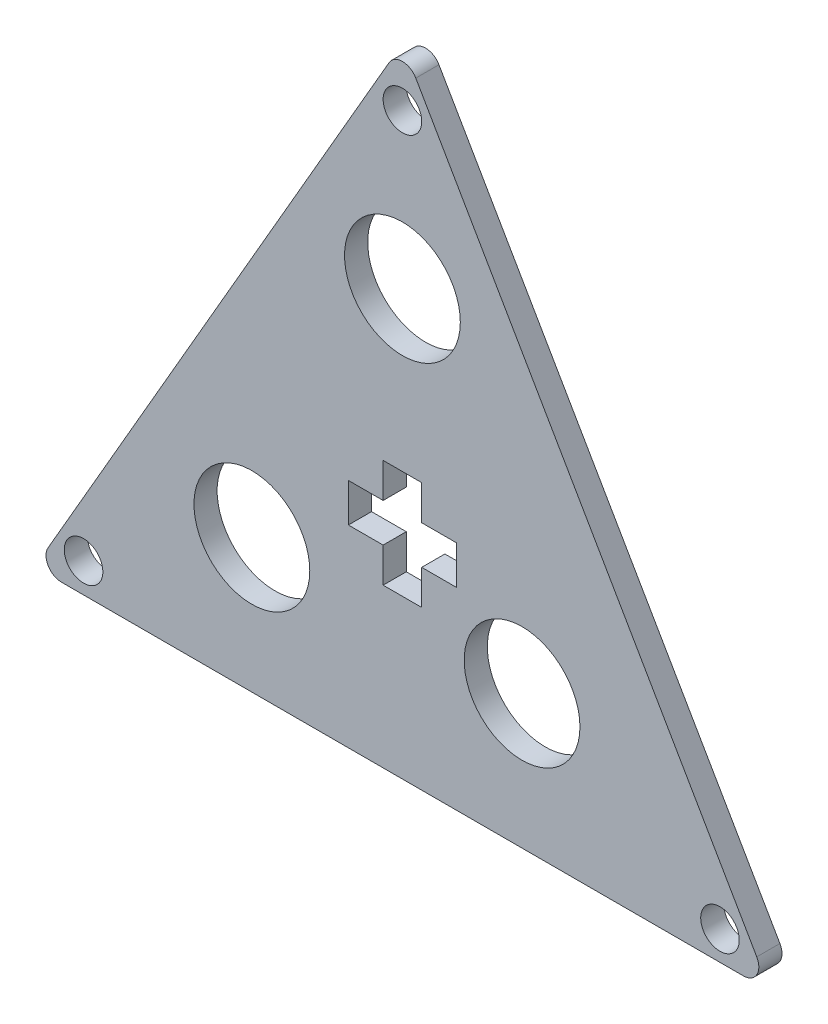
ISO-10303-21;
HEADER;
FILE_DESCRIPTION(('STEP AP214'),'2;1');
FILE_NAME('part.step','',(''),(''),'','','');
FILE_SCHEMA(('AUTOMOTIVE_DESIGN { 1 0 10303 214 1 1 1 1 }'));
ENDSEC;
DATA;
#1=APPLICATION_CONTEXT('core data for automotive mechanical design processes');
#2=APPLICATION_PROTOCOL_DEFINITION('international standard','automotive_design',2000,#1);
#3=PRODUCT_CONTEXT('',#1,'mechanical');
#4=PRODUCT('Part','Part','',(#3));
#5=PRODUCT_RELATED_PRODUCT_CATEGORY('part','',(#4));
#6=PRODUCT_DEFINITION_FORMATION('','',#4);
#7=PRODUCT_DEFINITION_CONTEXT('part definition',#1,'design');
#8=PRODUCT_DEFINITION('design','',#6,#7);
#9=PRODUCT_DEFINITION_SHAPE('','',#8);
#10=(LENGTH_UNIT() NAMED_UNIT(*) SI_UNIT(.MILLI.,.METRE.));
#11=(NAMED_UNIT(*) PLANE_ANGLE_UNIT() SI_UNIT($,.RADIAN.));
#12=(NAMED_UNIT(*) SI_UNIT($,.STERADIAN.) SOLID_ANGLE_UNIT());
#13=UNCERTAINTY_MEASURE_WITH_UNIT(LENGTH_MEASURE(1.E-05),#10,'distance_accuracy_value','');
#14=(GEOMETRIC_REPRESENTATION_CONTEXT(3) GLOBAL_UNCERTAINTY_ASSIGNED_CONTEXT((#13)) GLOBAL_UNIT_ASSIGNED_CONTEXT((#10,
#11,#12)) REPRESENTATION_CONTEXT('',''));
#15=CARTESIAN_POINT('',(0.,0.,0.));
#16=DIRECTION('',(0.,0.,1.));
#17=DIRECTION('',(1.,0.,0.));
#18=AXIS2_PLACEMENT_3D('',#15,#16,#17);
#19=CARTESIAN_POINT('',(0.,0.,3.));
#20=DIRECTION('',(0.,0.,1.));
#21=DIRECTION('',(1.,0.,0.));
#22=AXIS2_PLACEMENT_3D('',#19,#20,#21);
#23=PLANE('',#22);
#24=DIRECTION('',(1.,0.,0.));
#25=VECTOR('',#24,1.);
#26=CARTESIAN_POINT('',(-47.6313972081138,-27.500000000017,3.));
#27=LINE('',#26,#25);
#28=CARTESIAN_POINT('',(-44.167295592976,-27.500000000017,3.));
#29=VERTEX_POINT('',#28);
#30=CARTESIAN_POINT('',(44.1672955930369,-27.500000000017,3.));
#31=VERTEX_POINT('',#30);
#32=EDGE_CURVE('E320',#29,#31,#27,.T.);
#33=ORIENTED_EDGE('',*,*,#32,.T.);
#34=CARTESIAN_POINT('',(44.1672955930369,-25.500000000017,3.));
#35=DIRECTION('',(0.,0.,1.));
#36=DIRECTION('',(1.,0.,0.));
#37=AXIS2_PLACEMENT_3D('',#34,#35,#36);
#38=CIRCLE('',#37,2.);
#39=CARTESIAN_POINT('',(45.8993464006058,-24.500000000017,3.));
#40=VERTEX_POINT('',#39);
#41=EDGE_CURVE('E350',#31,#40,#38,.T.);
#42=ORIENTED_EDGE('',*,*,#41,.T.);
#43=DIRECTION('',(-0.500000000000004,0.866025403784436,0.));
#44=VECTOR('',#43,1.);
#45=CARTESIAN_POINT('',(47.6313972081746,-27.500000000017,3.));
#46=LINE('',#45,#44);
#47=CARTESIAN_POINT('',(1.73205080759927,51.9999999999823,3.));
#48=VERTEX_POINT('',#47);
#49=EDGE_CURVE('E313',#40,#48,#46,.T.);
#50=ORIENTED_EDGE('',*,*,#49,.T.);
#51=CARTESIAN_POINT('',(3.04101362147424E-11,50.9999999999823,3.));
#52=DIRECTION('',(0.,0.,1.));
#53=DIRECTION('',(1.,0.,0.));
#54=AXIS2_PLACEMENT_3D('',#51,#52,#53);
#55=CIRCLE('',#54,2.);
#56=CARTESIAN_POINT('',(-1.73205080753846,51.9999999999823,3.));
#57=VERTEX_POINT('',#56);
#58=EDGE_CURVE('E346',#48,#57,#55,.T.);
#59=ORIENTED_EDGE('',*,*,#58,.T.);
#60=DIRECTION('',(-0.500000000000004,-0.866025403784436,0.));
#61=VECTOR('',#60,1.);
#62=CARTESIAN_POINT('',(3.04090086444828E-11,54.9999999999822,3.));
#63=LINE('',#62,#61);
#64=CARTESIAN_POINT('',(-45.8993464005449,-24.500000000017,3.));
#65=VERTEX_POINT('',#64);
#66=EDGE_CURVE('E316',#57,#65,#63,.T.);
#67=ORIENTED_EDGE('',*,*,#66,.T.);
#68=CARTESIAN_POINT('',(-44.167295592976,-25.500000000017,3.));
#69=DIRECTION('',(0.,0.,1.));
#70=DIRECTION('',(1.,0.,0.));
#71=AXIS2_PLACEMENT_3D('',#68,#69,#70);
#72=CIRCLE('',#71,2.);
#73=EDGE_CURVE('E348',#65,#29,#72,.T.);
#74=ORIENTED_EDGE('',*,*,#73,.T.);
#75=EDGE_LOOP('',(#33,#42,#50,#59,#67,#74));
#76=FACE_BOUND('',#75,.T.);
#77=CARTESIAN_POINT('',(15.4976039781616,-10.148880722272,3.));
#78=DIRECTION('',(0.,0.,1.));
#79=DIRECTION('',(1.,0.,0.));
#80=AXIS2_PLACEMENT_3D('',#77,#78,#79);
#81=CIRCLE('',#80,7.5);
#82=CARTESIAN_POINT('',(22.9976039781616,-10.148880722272,3.));
#83=VERTEX_POINT('',#82);
#84=EDGE_CURVE('E308',#83,#83,#81,.T.);
#85=ORIENTED_EDGE('',*,*,#84,.F.);
#86=EDGE_LOOP('',(#85));
#87=FACE_BOUND('',#86,.T.);
#88=CARTESIAN_POINT('',(-19.5023960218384,-10.148880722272,3.));
#89=DIRECTION('',(0.,0.,1.));
#90=DIRECTION('',(1.,0.,0.));
#91=AXIS2_PLACEMENT_3D('',#88,#89,#90);
#92=CIRCLE('',#91,7.5);
#93=CARTESIAN_POINT('',(-12.0023960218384,-10.148880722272,3.));
#94=VERTEX_POINT('',#93);
#95=EDGE_CURVE('E302',#94,#94,#92,.T.);
#96=ORIENTED_EDGE('',*,*,#95,.F.);
#97=EDGE_LOOP('',(#96));
#98=FACE_BOUND('',#97,.T.);
#99=CARTESIAN_POINT('',(0.,27.4999999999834,3.));
#100=DIRECTION('',(0.,0.,1.));
#101=DIRECTION('',(1.,0.,0.));
#102=AXIS2_PLACEMENT_3D('',#99,#100,#101);
#103=CIRCLE('',#102,7.50000000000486);
#104=CARTESIAN_POINT('',(7.50000000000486,27.4999999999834,3.));
#105=VERTEX_POINT('',#104);
#106=EDGE_CURVE('E299',#105,#105,#103,.T.);
#107=ORIENTED_EDGE('',*,*,#106,.F.);
#108=EDGE_LOOP('',(#107));
#109=FACE_BOUND('',#108,.T.);
#110=CARTESIAN_POINT('',(41.1362066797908,-23.7500000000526,3.));
#111=DIRECTION('',(0.,0.,1.));
#112=DIRECTION('',(-1.,0.,0.));
#113=AXIS2_PLACEMENT_3D('',#110,#111,#112);
#114=CIRCLE('',#113,2.50000000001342);
#115=CARTESIAN_POINT('',(38.6362066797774,-23.7500000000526,3.));
#116=VERTEX_POINT('',#115);
#117=EDGE_CURVE('E290',#116,#116,#114,.T.);
#118=ORIENTED_EDGE('',*,*,#117,.F.);
#119=EDGE_LOOP('',(#118));
#120=FACE_BOUND('',#119,.T.);
#121=CARTESIAN_POINT('',(-41.3052240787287,-23.6714710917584,3.));
#122=DIRECTION('',(0.,0.,1.));
#123=DIRECTION('',(-1.,0.,0.));
#124=AXIS2_PLACEMENT_3D('',#121,#122,#123);
#125=CIRCLE('',#124,2.50000000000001);
#126=CARTESIAN_POINT('',(-43.8052240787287,-23.6714710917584,3.));
#127=VERTEX_POINT('',#126);
#128=EDGE_CURVE('E284',#127,#127,#125,.T.);
#129=ORIENTED_EDGE('',*,*,#128,.F.);
#130=EDGE_LOOP('',(#129));
#131=FACE_BOUND('',#130,.T.);
#132=CARTESIAN_POINT('',(0.,47.5,3.));
#133=DIRECTION('',(0.,0.,1.));
#134=DIRECTION('',(1.,0.,0.));
#135=AXIS2_PLACEMENT_3D('',#132,#133,#134);
#136=CIRCLE('',#135,2.5);
#137=CARTESIAN_POINT('',(2.5,47.5,3.));
#138=VERTEX_POINT('',#137);
#139=EDGE_CURVE('E281',#138,#138,#136,.T.);
#140=ORIENTED_EDGE('',*,*,#139,.F.);
#141=EDGE_LOOP('',(#140));
#142=FACE_BOUND('',#141,.T.);
#143=DIRECTION('',(0.,1.,0.));
#144=VECTOR('',#143,1.);
#145=CARTESIAN_POINT('',(2.5,-7.,3.));
#146=LINE('',#145,#144);
#147=CARTESIAN_POINT('',(2.5,-7.,3.));
#148=VERTEX_POINT('',#147);
#149=CARTESIAN_POINT('',(2.5,-2.5,3.));
#150=VERTEX_POINT('',#149);
#151=EDGE_CURVE('E224',#148,#150,#146,.T.);
#152=ORIENTED_EDGE('',*,*,#151,.F.);
#153=DIRECTION('',(-1.,0.,0.));
#154=VECTOR('',#153,1.);
#155=CARTESIAN_POINT('',(2.5,-7.,3.));
#156=LINE('',#155,#154);
#157=CARTESIAN_POINT('',(-2.5,-7.,3.));
#158=VERTEX_POINT('',#157);
#159=EDGE_CURVE('E213',#148,#158,#156,.T.);
#160=ORIENTED_EDGE('',*,*,#159,.T.);
#161=DIRECTION('',(0.,1.,0.));
#162=VECTOR('',#161,1.);
#163=CARTESIAN_POINT('',(-2.5,-7.,3.));
#164=LINE('',#163,#162);
#165=CARTESIAN_POINT('',(-2.5,-2.5,3.));
#166=VERTEX_POINT('',#165);
#167=EDGE_CURVE('E217',#158,#166,#164,.T.);
#168=ORIENTED_EDGE('',*,*,#167,.T.);
#169=DIRECTION('',(-1.,0.,0.));
#170=VECTOR('',#169,1.);
#171=CARTESIAN_POINT('',(7.,-2.5,3.));
#172=LINE('',#171,#170);
#173=CARTESIAN_POINT('',(-7.,-2.5,3.));
#174=VERTEX_POINT('',#173);
#175=EDGE_CURVE('E258',#166,#174,#172,.T.);
#176=ORIENTED_EDGE('',*,*,#175,.T.);
#177=DIRECTION('',(0.,1.,0.));
#178=VECTOR('',#177,1.);
#179=CARTESIAN_POINT('',(-7.,-2.5,3.));
#180=LINE('',#179,#178);
#181=CARTESIAN_POINT('',(-7.,2.5,3.));
#182=VERTEX_POINT('',#181);
#183=EDGE_CURVE('E255',#174,#182,#180,.T.);
#184=ORIENTED_EDGE('',*,*,#183,.T.);
#185=DIRECTION('',(-1.,0.,0.));
#186=VECTOR('',#185,1.);
#187=CARTESIAN_POINT('',(7.,2.5,3.));
#188=LINE('',#187,#186);
#189=CARTESIAN_POINT('',(-2.5,2.5,3.));
#190=VERTEX_POINT('',#189);
#191=EDGE_CURVE('E251',#190,#182,#188,.T.);
#192=ORIENTED_EDGE('',*,*,#191,.F.);
#193=CARTESIAN_POINT('',(-2.5,7.,3.));
#194=VERTEX_POINT('',#193);
#195=EDGE_CURVE('E229',#190,#194,#164,.T.);
#196=ORIENTED_EDGE('',*,*,#195,.T.);
#197=DIRECTION('',(-1.,0.,0.));
#198=VECTOR('',#197,1.);
#199=CARTESIAN_POINT('',(2.5,7.,3.));
#200=LINE('',#199,#198);
#201=CARTESIAN_POINT('',(2.5,7.,3.));
#202=VERTEX_POINT('',#201);
#203=EDGE_CURVE('E227',#202,#194,#200,.T.);
#204=ORIENTED_EDGE('',*,*,#203,.F.);
#205=CARTESIAN_POINT('',(2.5,2.5,3.));
#206=VERTEX_POINT('',#205);
#207=EDGE_CURVE('E191',#206,#202,#146,.T.);
#208=ORIENTED_EDGE('',*,*,#207,.F.);
#209=CARTESIAN_POINT('',(7.,2.5,3.));
#210=VERTEX_POINT('',#209);
#211=EDGE_CURVE('E252',#210,#206,#188,.T.);
#212=ORIENTED_EDGE('',*,*,#211,.F.);
#213=DIRECTION('',(0.,1.,0.));
#214=VECTOR('',#213,1.);
#215=CARTESIAN_POINT('',(7.,-2.5,3.));
#216=LINE('',#215,#214);
#217=CARTESIAN_POINT('',(7.,-2.5,3.));
#218=VERTEX_POINT('',#217);
#219=EDGE_CURVE('E80',#218,#210,#216,.T.);
#220=ORIENTED_EDGE('',*,*,#219,.F.);
#221=EDGE_CURVE('E241',#218,#150,#172,.T.);
#222=ORIENTED_EDGE('',*,*,#221,.T.);
#223=EDGE_LOOP('',(#152,#160,#168,#176,#184,#192,#196,#204,#208,#212,#220,#222));
#224=FACE_BOUND('',#223,.T.);
#225=ADVANCED_FACE('F65',(#76,#87,#98,#109,#120,#131,#142,#224),#23,.T.);
#226=CARTESIAN_POINT('',(0.,0.,0.));
#227=DIRECTION('',(0.,0.,1.));
#228=DIRECTION('',(1.,0.,0.));
#229=AXIS2_PLACEMENT_3D('',#226,#227,#228);
#230=PLANE('',#229);
#231=DIRECTION('',(-0.500000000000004,0.866025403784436,0.));
#232=VECTOR('',#231,1.);
#233=CARTESIAN_POINT('',(47.6313972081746,-27.500000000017,0.));
#234=LINE('',#233,#232);
#235=CARTESIAN_POINT('',(45.8993464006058,-24.500000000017,0.));
#236=VERTEX_POINT('',#235);
#237=CARTESIAN_POINT('',(1.73205080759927,51.9999999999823,0.));
#238=VERTEX_POINT('',#237);
#239=EDGE_CURVE('E298',#236,#238,#234,.T.);
#240=ORIENTED_EDGE('',*,*,#239,.F.);
#241=CARTESIAN_POINT('',(44.1672955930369,-25.500000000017,0.));
#242=DIRECTION('',(0.,0.,1.));
#243=DIRECTION('',(1.,0.,0.));
#244=AXIS2_PLACEMENT_3D('',#241,#242,#243);
#245=CIRCLE('',#244,2.);
#246=CARTESIAN_POINT('',(44.1672955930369,-27.500000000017,0.));
#247=VERTEX_POINT('',#246);
#248=EDGE_CURVE('E339',#236,#247,#245,.F.);
#249=ORIENTED_EDGE('',*,*,#248,.T.);
#250=DIRECTION('',(1.,0.,0.));
#251=VECTOR('',#250,1.);
#252=CARTESIAN_POINT('',(-47.6313972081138,-27.500000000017,0.));
#253=LINE('',#252,#251);
#254=CARTESIAN_POINT('',(-44.167295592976,-27.500000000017,0.));
#255=VERTEX_POINT('',#254);
#256=EDGE_CURVE('E317',#255,#247,#253,.T.);
#257=ORIENTED_EDGE('',*,*,#256,.F.);
#258=CARTESIAN_POINT('',(-44.167295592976,-25.500000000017,0.));
#259=DIRECTION('',(0.,0.,1.));
#260=DIRECTION('',(1.,0.,0.));
#261=AXIS2_PLACEMENT_3D('',#258,#259,#260);
#262=CIRCLE('',#261,2.);
#263=CARTESIAN_POINT('',(-45.8993464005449,-24.500000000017,0.));
#264=VERTEX_POINT('',#263);
#265=EDGE_CURVE('E337',#255,#264,#262,.F.);
#266=ORIENTED_EDGE('',*,*,#265,.T.);
#267=DIRECTION('',(-0.500000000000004,-0.866025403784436,0.));
#268=VECTOR('',#267,1.);
#269=CARTESIAN_POINT('',(3.04090086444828E-11,54.9999999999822,0.));
#270=LINE('',#269,#268);
#271=CARTESIAN_POINT('',(-1.73205080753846,51.9999999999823,0.));
#272=VERTEX_POINT('',#271);
#273=EDGE_CURVE('E326',#272,#264,#270,.T.);
#274=ORIENTED_EDGE('',*,*,#273,.F.);
#275=CARTESIAN_POINT('',(3.04101362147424E-11,50.9999999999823,0.));
#276=DIRECTION('',(0.,0.,1.));
#277=DIRECTION('',(1.,0.,0.));
#278=AXIS2_PLACEMENT_3D('',#275,#276,#277);
#279=CIRCLE('',#278,2.);
#280=EDGE_CURVE('E335',#272,#238,#279,.F.);
#281=ORIENTED_EDGE('',*,*,#280,.T.);
#282=EDGE_LOOP('',(#240,#249,#257,#266,#274,#281));
#283=FACE_BOUND('',#282,.T.);
#284=CARTESIAN_POINT('',(15.4976039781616,-10.148880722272,0.));
#285=DIRECTION('',(0.,0.,1.));
#286=DIRECTION('',(1.,0.,0.));
#287=AXIS2_PLACEMENT_3D('',#284,#285,#286);
#288=CIRCLE('',#287,7.5);
#289=CARTESIAN_POINT('',(22.9976039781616,-10.148880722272,0.));
#290=VERTEX_POINT('',#289);
#291=EDGE_CURVE('E280',#290,#290,#288,.T.);
#292=ORIENTED_EDGE('',*,*,#291,.T.);
#293=EDGE_LOOP('',(#292));
#294=FACE_BOUND('',#293,.T.);
#295=CARTESIAN_POINT('',(-19.5023960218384,-10.148880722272,0.));
#296=DIRECTION('',(0.,0.,1.));
#297=DIRECTION('',(1.,0.,0.));
#298=AXIS2_PLACEMENT_3D('',#295,#296,#297);
#299=CIRCLE('',#298,7.5);
#300=CARTESIAN_POINT('',(-12.0023960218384,-10.148880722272,0.));
#301=VERTEX_POINT('',#300);
#302=EDGE_CURVE('E305',#301,#301,#299,.T.);
#303=ORIENTED_EDGE('',*,*,#302,.T.);
#304=EDGE_LOOP('',(#303));
#305=FACE_BOUND('',#304,.T.);
#306=CARTESIAN_POINT('',(0.,27.4999999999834,0.));
#307=DIRECTION('',(0.,0.,1.));
#308=DIRECTION('',(1.,0.,0.));
#309=AXIS2_PLACEMENT_3D('',#306,#307,#308);
#310=CIRCLE('',#309,7.50000000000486);
#311=CARTESIAN_POINT('',(7.50000000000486,27.4999999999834,0.));
#312=VERTEX_POINT('',#311);
#313=EDGE_CURVE('E295',#312,#312,#310,.T.);
#314=ORIENTED_EDGE('',*,*,#313,.T.);
#315=EDGE_LOOP('',(#314));
#316=FACE_BOUND('',#315,.T.);
#317=CARTESIAN_POINT('',(41.1362066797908,-23.7500000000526,0.));
#318=DIRECTION('',(0.,0.,1.));
#319=DIRECTION('',(-1.,0.,0.));
#320=AXIS2_PLACEMENT_3D('',#317,#318,#319);
#321=CIRCLE('',#320,2.50000000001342);
#322=CARTESIAN_POINT('',(38.6362066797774,-23.7500000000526,0.));
#323=VERTEX_POINT('',#322);
#324=EDGE_CURVE('E276',#323,#323,#321,.T.);
#325=ORIENTED_EDGE('',*,*,#324,.T.);
#326=EDGE_LOOP('',(#325));
#327=FACE_BOUND('',#326,.T.);
#328=CARTESIAN_POINT('',(-41.3052240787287,-23.6714710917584,0.));
#329=DIRECTION('',(0.,0.,1.));
#330=DIRECTION('',(-1.,0.,0.));
#331=AXIS2_PLACEMENT_3D('',#328,#329,#330);
#332=CIRCLE('',#331,2.50000000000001);
#333=CARTESIAN_POINT('',(-43.8052240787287,-23.6714710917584,0.));
#334=VERTEX_POINT('',#333);
#335=EDGE_CURVE('E287',#334,#334,#332,.T.);
#336=ORIENTED_EDGE('',*,*,#335,.T.);
#337=EDGE_LOOP('',(#336));
#338=FACE_BOUND('',#337,.T.);
#339=CARTESIAN_POINT('',(0.,47.5,0.));
#340=DIRECTION('',(0.,0.,1.));
#341=DIRECTION('',(1.,0.,0.));
#342=AXIS2_PLACEMENT_3D('',#339,#340,#341);
#343=CIRCLE('',#342,2.5);
#344=CARTESIAN_POINT('',(2.5,47.5,0.));
#345=VERTEX_POINT('',#344);
#346=EDGE_CURVE('E277',#345,#345,#343,.T.);
#347=ORIENTED_EDGE('',*,*,#346,.T.);
#348=EDGE_LOOP('',(#347));
#349=FACE_BOUND('',#348,.T.);
#350=DIRECTION('',(-1.,0.,0.));
#351=VECTOR('',#350,1.);
#352=CARTESIAN_POINT('',(2.5,-7.,0.));
#353=LINE('',#352,#351);
#354=CARTESIAN_POINT('',(2.5,-7.,0.));
#355=VERTEX_POINT('',#354);
#356=CARTESIAN_POINT('',(-2.5,-7.,0.));
#357=VERTEX_POINT('',#356);
#358=EDGE_CURVE('E196',#355,#357,#353,.T.);
#359=ORIENTED_EDGE('',*,*,#358,.F.);
#360=DIRECTION('',(0.,1.,0.));
#361=VECTOR('',#360,1.);
#362=CARTESIAN_POINT('',(2.5,-7.,0.));
#363=LINE('',#362,#361);
#364=CARTESIAN_POINT('',(2.5,-2.5,0.));
#365=VERTEX_POINT('',#364);
#366=EDGE_CURVE('E205',#355,#365,#363,.T.);
#367=ORIENTED_EDGE('',*,*,#366,.T.);
#368=DIRECTION('',(-1.,0.,0.));
#369=VECTOR('',#368,1.);
#370=CARTESIAN_POINT('',(7.,-2.5,0.));
#371=LINE('',#370,#369);
#372=CARTESIAN_POINT('',(7.,-2.5,0.));
#373=VERTEX_POINT('',#372);
#374=EDGE_CURVE('E246',#373,#365,#371,.T.);
#375=ORIENTED_EDGE('',*,*,#374,.F.);
#376=DIRECTION('',(0.,1.,0.));
#377=VECTOR('',#376,1.);
#378=CARTESIAN_POINT('',(7.,-2.5,0.));
#379=LINE('',#378,#377);
#380=CARTESIAN_POINT('',(7.,2.5,0.));
#381=VERTEX_POINT('',#380);
#382=EDGE_CURVE('E238',#373,#381,#379,.T.);
#383=ORIENTED_EDGE('',*,*,#382,.T.);
#384=DIRECTION('',(-1.,0.,0.));
#385=VECTOR('',#384,1.);
#386=CARTESIAN_POINT('',(7.,2.5,0.));
#387=LINE('',#386,#385);
#388=CARTESIAN_POINT('',(2.5,2.5,0.));
#389=VERTEX_POINT('',#388);
#390=EDGE_CURVE('E212',#381,#389,#387,.T.);
#391=ORIENTED_EDGE('',*,*,#390,.T.);
#392=CARTESIAN_POINT('',(2.5,7.,0.));
#393=VERTEX_POINT('',#392);
#394=EDGE_CURVE('E88',#389,#393,#363,.T.);
#395=ORIENTED_EDGE('',*,*,#394,.T.);
#396=DIRECTION('',(-1.,0.,0.));
#397=VECTOR('',#396,1.);
#398=CARTESIAN_POINT('',(2.5,7.,0.));
#399=LINE('',#398,#397);
#400=CARTESIAN_POINT('',(-2.5,7.,0.));
#401=VERTEX_POINT('',#400);
#402=EDGE_CURVE('E200',#393,#401,#399,.T.);
#403=ORIENTED_EDGE('',*,*,#402,.T.);
#404=DIRECTION('',(0.,1.,0.));
#405=VECTOR('',#404,1.);
#406=CARTESIAN_POINT('',(-2.5,-7.,0.));
#407=LINE('',#406,#405);
#408=CARTESIAN_POINT('',(-2.5,2.5,0.));
#409=VERTEX_POINT('',#408);
#410=EDGE_CURVE('E204',#409,#401,#407,.T.);
#411=ORIENTED_EDGE('',*,*,#410,.F.);
#412=CARTESIAN_POINT('',(-7.,2.5,0.));
#413=VERTEX_POINT('',#412);
#414=EDGE_CURVE('E240',#409,#413,#387,.T.);
#415=ORIENTED_EDGE('',*,*,#414,.T.);
#416=DIRECTION('',(0.,1.,0.));
#417=VECTOR('',#416,1.);
#418=CARTESIAN_POINT('',(-7.,-2.5,0.));
#419=LINE('',#418,#417);
#420=CARTESIAN_POINT('',(-7.,-2.5,0.));
#421=VERTEX_POINT('',#420);
#422=EDGE_CURVE('E243',#421,#413,#419,.T.);
#423=ORIENTED_EDGE('',*,*,#422,.F.);
#424=CARTESIAN_POINT('',(-2.5,-2.5,0.));
#425=VERTEX_POINT('',#424);
#426=EDGE_CURVE('E245',#425,#421,#371,.T.);
#427=ORIENTED_EDGE('',*,*,#426,.F.);
#428=EDGE_CURVE('E220',#357,#425,#407,.T.);
#429=ORIENTED_EDGE('',*,*,#428,.F.);
#430=EDGE_LOOP('',(#359,#367,#375,#383,#391,#395,#403,#411,#415,#423,#427,#429));
#431=FACE_BOUND('',#430,.T.);
#432=ADVANCED_FACE('F209',(#283,#294,#305,#316,#327,#338,#349,#431),#230,.F.);
#433=CARTESIAN_POINT('',(47.6313972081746,-27.500000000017,3.));
#434=DIRECTION('',(-0.866025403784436,-0.500000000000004,0.));
#435=DIRECTION('',(0.500000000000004,-0.866025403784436,0.));
#436=AXIS2_PLACEMENT_3D('',#433,#434,#435);
#437=PLANE('',#436);
#438=ORIENTED_EDGE('',*,*,#49,.F.);
#439=DIRECTION('',(0.,0.,-1.));
#440=VECTOR('',#439,1.);
#441=CARTESIAN_POINT('',(45.8993464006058,-24.500000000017,3.));
#442=LINE('',#441,#440);
#443=EDGE_CURVE('E332',#40,#236,#442,.T.);
#444=ORIENTED_EDGE('',*,*,#443,.T.);
#445=ORIENTED_EDGE('',*,*,#239,.T.);
#446=DIRECTION('',(0.,0.,-1.));
#447=VECTOR('',#446,1.);
#448=CARTESIAN_POINT('',(1.73205080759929,51.9999999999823,3.));
#449=LINE('',#448,#447);
#450=EDGE_CURVE('E323',#238,#48,#449,.F.);
#451=ORIENTED_EDGE('',*,*,#450,.T.);
#452=EDGE_LOOP('',(#438,#444,#445,#451));
#453=FACE_BOUND('',#452,.T.);
#454=ADVANCED_FACE('F380',(#453),#437,.F.);
#455=CARTESIAN_POINT('',(3.04090086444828E-11,54.9999999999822,3.));
#456=DIRECTION('',(0.866025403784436,-0.500000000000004,0.));
#457=DIRECTION('',(0.500000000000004,0.866025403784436,0.));
#458=AXIS2_PLACEMENT_3D('',#455,#456,#457);
#459=PLANE('',#458);
#460=ORIENTED_EDGE('',*,*,#273,.T.);
#461=DIRECTION('',(0.,0.,-1.));
#462=VECTOR('',#461,1.);
#463=CARTESIAN_POINT('',(-45.8993464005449,-24.500000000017,3.));
#464=LINE('',#463,#462);
#465=EDGE_CURVE('E12',#264,#65,#464,.F.);
#466=ORIENTED_EDGE('',*,*,#465,.T.);
#467=ORIENTED_EDGE('',*,*,#66,.F.);
#468=DIRECTION('',(0.,0.,-1.));
#469=VECTOR('',#468,1.);
#470=CARTESIAN_POINT('',(-1.73205080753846,51.9999999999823,3.));
#471=LINE('',#470,#469);
#472=EDGE_CURVE('E73',#57,#272,#471,.T.);
#473=ORIENTED_EDGE('',*,*,#472,.T.);
#474=EDGE_LOOP('',(#460,#466,#467,#473));
#475=FACE_BOUND('',#474,.T.);
#476=ADVANCED_FACE('F356',(#475),#459,.F.);
#477=CARTESIAN_POINT('',(-47.6313972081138,-27.500000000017,3.));
#478=DIRECTION('',(0.,1.,0.));
#479=DIRECTION('',(0.,0.,1.));
#480=AXIS2_PLACEMENT_3D('',#477,#478,#479);
#481=PLANE('',#480);
#482=ORIENTED_EDGE('',*,*,#256,.T.);
#483=DIRECTION('',(0.,0.,-1.));
#484=VECTOR('',#483,1.);
#485=CARTESIAN_POINT('',(44.1672955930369,-27.500000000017,3.));
#486=LINE('',#485,#484);
#487=EDGE_CURVE('E344',#247,#31,#486,.F.);
#488=ORIENTED_EDGE('',*,*,#487,.T.);
#489=ORIENTED_EDGE('',*,*,#32,.F.);
#490=DIRECTION('',(0.,0.,-1.));
#491=VECTOR('',#490,1.);
#492=CARTESIAN_POINT('',(-44.167295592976,-27.500000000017,3.));
#493=LINE('',#492,#491);
#494=EDGE_CURVE('E341',#29,#255,#493,.T.);
#495=ORIENTED_EDGE('',*,*,#494,.T.);
#496=EDGE_LOOP('',(#482,#488,#489,#495));
#497=FACE_BOUND('',#496,.T.);
#498=ADVANCED_FACE('F370',(#497),#481,.F.);
#499=CARTESIAN_POINT('',(44.1672955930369,-25.500000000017,3.));
#500=DIRECTION('',(0.,0.,-1.));
#501=DIRECTION('',(-1.,0.,0.));
#502=AXIS2_PLACEMENT_3D('',#499,#500,#501);
#503=CYLINDRICAL_SURFACE('',#502,2.);
#504=ORIENTED_EDGE('',*,*,#41,.F.);
#505=ORIENTED_EDGE('',*,*,#487,.F.);
#506=ORIENTED_EDGE('',*,*,#248,.F.);
#507=ORIENTED_EDGE('',*,*,#443,.F.);
#508=EDGE_LOOP('',(#504,#505,#506,#507));
#509=FACE_BOUND('',#508,.T.);
#510=ADVANCED_FACE('F378',(#509),#503,.T.);
#511=CARTESIAN_POINT('',(-44.167295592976,-25.500000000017,3.));
#512=DIRECTION('',(0.,0.,-1.));
#513=DIRECTION('',(-1.,0.,0.));
#514=AXIS2_PLACEMENT_3D('',#511,#512,#513);
#515=CYLINDRICAL_SURFACE('',#514,2.);
#516=ORIENTED_EDGE('',*,*,#73,.F.);
#517=ORIENTED_EDGE('',*,*,#465,.F.);
#518=ORIENTED_EDGE('',*,*,#265,.F.);
#519=ORIENTED_EDGE('',*,*,#494,.F.);
#520=EDGE_LOOP('',(#516,#517,#518,#519));
#521=FACE_BOUND('',#520,.T.);
#522=ADVANCED_FACE('F367',(#521),#515,.T.);
#523=CARTESIAN_POINT('',(3.04101362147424E-11,50.9999999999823,3.));
#524=DIRECTION('',(0.,0.,-1.));
#525=DIRECTION('',(-1.,0.,0.));
#526=AXIS2_PLACEMENT_3D('',#523,#524,#525);
#527=CYLINDRICAL_SURFACE('',#526,2.);
#528=ORIENTED_EDGE('',*,*,#58,.F.);
#529=ORIENTED_EDGE('',*,*,#450,.F.);
#530=ORIENTED_EDGE('',*,*,#280,.F.);
#531=ORIENTED_EDGE('',*,*,#472,.F.);
#532=EDGE_LOOP('',(#528,#529,#530,#531));
#533=FACE_BOUND('',#532,.T.);
#534=ADVANCED_FACE('F67',(#533),#527,.T.);
#535=CARTESIAN_POINT('',(15.4976039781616,-10.148880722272,0.));
#536=DIRECTION('',(0.,0.,1.));
#537=DIRECTION('',(1.,0.,0.));
#538=AXIS2_PLACEMENT_3D('',#535,#536,#537);
#539=CYLINDRICAL_SURFACE('',#538,7.5);
#540=ORIENTED_EDGE('',*,*,#291,.F.);
#541=EDGE_LOOP('',(#540));
#542=FACE_BOUND('',#541,.T.);
#543=ORIENTED_EDGE('',*,*,#84,.T.);
#544=EDGE_LOOP('',(#543));
#545=FACE_BOUND('',#544,.T.);
#546=ADVANCED_FACE('F383',(#542,#545),#539,.F.);
#547=CARTESIAN_POINT('',(-19.5023960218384,-10.148880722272,0.));
#548=DIRECTION('',(0.,0.,1.));
#549=DIRECTION('',(1.,0.,0.));
#550=AXIS2_PLACEMENT_3D('',#547,#548,#549);
#551=CYLINDRICAL_SURFACE('',#550,7.5);
#552=ORIENTED_EDGE('',*,*,#302,.F.);
#553=EDGE_LOOP('',(#552));
#554=FACE_BOUND('',#553,.T.);
#555=ORIENTED_EDGE('',*,*,#95,.T.);
#556=EDGE_LOOP('',(#555));
#557=FACE_BOUND('',#556,.T.);
#558=ADVANCED_FACE('F388',(#554,#557),#551,.F.);
#559=CARTESIAN_POINT('',(0.,27.4999999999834,0.));
#560=DIRECTION('',(0.,0.,1.));
#561=DIRECTION('',(1.,0.,0.));
#562=AXIS2_PLACEMENT_3D('',#559,#560,#561);
#563=CYLINDRICAL_SURFACE('',#562,7.50000000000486);
#564=ORIENTED_EDGE('',*,*,#313,.F.);
#565=EDGE_LOOP('',(#564));
#566=FACE_BOUND('',#565,.T.);
#567=ORIENTED_EDGE('',*,*,#106,.T.);
#568=EDGE_LOOP('',(#567));
#569=FACE_BOUND('',#568,.T.);
#570=ADVANCED_FACE('F436',(#566,#569),#563,.F.);
#571=CARTESIAN_POINT('',(41.1362066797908,-23.7500000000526,0.));
#572=DIRECTION('',(0.,0.,1.));
#573=DIRECTION('',(1.,0.,0.));
#574=AXIS2_PLACEMENT_3D('',#571,#572,#573);
#575=CYLINDRICAL_SURFACE('',#574,2.50000000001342);
#576=ORIENTED_EDGE('',*,*,#324,.F.);
#577=EDGE_LOOP('',(#576));
#578=FACE_BOUND('',#577,.T.);
#579=ORIENTED_EDGE('',*,*,#117,.T.);
#580=EDGE_LOOP('',(#579));
#581=FACE_BOUND('',#580,.T.);
#582=ADVANCED_FACE('F445',(#578,#581),#575,.F.);
#583=CARTESIAN_POINT('',(-41.3052240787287,-23.6714710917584,0.));
#584=DIRECTION('',(0.,0.,1.));
#585=DIRECTION('',(1.,0.,0.));
#586=AXIS2_PLACEMENT_3D('',#583,#584,#585);
#587=CYLINDRICAL_SURFACE('',#586,2.50000000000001);
#588=ORIENTED_EDGE('',*,*,#335,.F.);
#589=EDGE_LOOP('',(#588));
#590=FACE_BOUND('',#589,.T.);
#591=ORIENTED_EDGE('',*,*,#128,.T.);
#592=EDGE_LOOP('',(#591));
#593=FACE_BOUND('',#592,.T.);
#594=ADVANCED_FACE('F455',(#590,#593),#587,.F.);
#595=CARTESIAN_POINT('',(0.,47.5,0.));
#596=DIRECTION('',(0.,0.,1.));
#597=DIRECTION('',(1.,0.,0.));
#598=AXIS2_PLACEMENT_3D('',#595,#596,#597);
#599=CYLINDRICAL_SURFACE('',#598,2.5);
#600=ORIENTED_EDGE('',*,*,#346,.F.);
#601=EDGE_LOOP('',(#600));
#602=FACE_BOUND('',#601,.T.);
#603=ORIENTED_EDGE('',*,*,#139,.T.);
#604=EDGE_LOOP('',(#603));
#605=FACE_BOUND('',#604,.T.);
#606=ADVANCED_FACE('F465',(#602,#605),#599,.F.);
#607=CARTESIAN_POINT('',(-2.5,-7.,0.));
#608=DIRECTION('',(1.,0.,0.));
#609=DIRECTION('',(0.,0.,-1.));
#610=AXIS2_PLACEMENT_3D('',#607,#608,#609);
#611=PLANE('',#610);
#612=ORIENTED_EDGE('',*,*,#410,.T.);
#613=DIRECTION('',(0.,0.,1.));
#614=VECTOR('',#613,1.);
#615=CARTESIAN_POINT('',(-2.5,7.,0.));
#616=LINE('',#615,#614);
#617=EDGE_CURVE('E195',#401,#194,#616,.T.);
#618=ORIENTED_EDGE('',*,*,#617,.T.);
#619=ORIENTED_EDGE('',*,*,#195,.F.);
#620=DIRECTION('',(0.,0.,1.));
#621=VECTOR('',#620,1.);
#622=CARTESIAN_POINT('',(-2.5,2.5,0.));
#623=LINE('',#622,#621);
#624=EDGE_CURVE('E234',#409,#190,#623,.T.);
#625=ORIENTED_EDGE('',*,*,#624,.F.);
#626=EDGE_LOOP('',(#612,#618,#619,#625));
#627=FACE_BOUND('',#626,.T.);
#628=ADVANCED_FACE('F474',(#627),#611,.T.);
#629=CARTESIAN_POINT('',(2.5,7.,0.));
#630=DIRECTION('',(0.,1.,0.));
#631=DIRECTION('',(-1.,0.,0.));
#632=AXIS2_PLACEMENT_3D('',#629,#630,#631);
#633=PLANE('',#632);
#634=ORIENTED_EDGE('',*,*,#203,.T.);
#635=ORIENTED_EDGE('',*,*,#617,.F.);
#636=ORIENTED_EDGE('',*,*,#402,.F.);
#637=DIRECTION('',(0.,0.,1.));
#638=VECTOR('',#637,1.);
#639=CARTESIAN_POINT('',(2.5,7.,0.));
#640=LINE('',#639,#638);
#641=EDGE_CURVE('E187',#393,#202,#640,.T.);
#642=ORIENTED_EDGE('',*,*,#641,.T.);
#643=EDGE_LOOP('',(#634,#635,#636,#642));
#644=FACE_BOUND('',#643,.T.);
#645=ADVANCED_FACE('F201',(#644),#633,.F.);
#646=CARTESIAN_POINT('',(2.5,-7.,0.));
#647=DIRECTION('',(1.,0.,0.));
#648=DIRECTION('',(0.,0.,-1.));
#649=AXIS2_PLACEMENT_3D('',#646,#647,#648);
#650=PLANE('',#649);
#651=DIRECTION('',(0.,0.,1.));
#652=VECTOR('',#651,1.);
#653=CARTESIAN_POINT('',(2.5,2.5,0.));
#654=LINE('',#653,#652);
#655=EDGE_CURVE('E271',#389,#206,#654,.T.);
#656=ORIENTED_EDGE('',*,*,#655,.T.);
#657=ORIENTED_EDGE('',*,*,#207,.T.);
#658=ORIENTED_EDGE('',*,*,#641,.F.);
#659=ORIENTED_EDGE('',*,*,#394,.F.);
#660=EDGE_LOOP('',(#656,#657,#658,#659));
#661=FACE_BOUND('',#660,.T.);
#662=ADVANCED_FACE('F189',(#661),#650,.F.);
#663=CARTESIAN_POINT('',(2.5,-7.,0.));
#664=DIRECTION('',(0.,1.,0.));
#665=DIRECTION('',(-1.,0.,0.));
#666=AXIS2_PLACEMENT_3D('',#663,#664,#665);
#667=PLANE('',#666);
#668=ORIENTED_EDGE('',*,*,#159,.F.);
#669=DIRECTION('',(0.,0.,1.));
#670=VECTOR('',#669,1.);
#671=CARTESIAN_POINT('',(2.5,-7.,0.));
#672=LINE('',#671,#670);
#673=EDGE_CURVE('E232',#355,#148,#672,.T.);
#674=ORIENTED_EDGE('',*,*,#673,.F.);
#675=ORIENTED_EDGE('',*,*,#358,.T.);
#676=DIRECTION('',(0.,0.,1.));
#677=VECTOR('',#676,1.);
#678=CARTESIAN_POINT('',(-2.5,-7.,0.));
#679=LINE('',#678,#677);
#680=EDGE_CURVE('E235',#357,#158,#679,.T.);
#681=ORIENTED_EDGE('',*,*,#680,.T.);
#682=EDGE_LOOP('',(#668,#674,#675,#681));
#683=FACE_BOUND('',#682,.T.);
#684=ADVANCED_FACE('F511',(#683),#667,.T.);
#685=DIRECTION('',(0.,0.,1.));
#686=VECTOR('',#685,1.);
#687=CARTESIAN_POINT('',(-2.5,-2.5,0.));
#688=LINE('',#687,#686);
#689=EDGE_CURVE('E270',#425,#166,#688,.T.);
#690=ORIENTED_EDGE('',*,*,#689,.T.);
#691=ORIENTED_EDGE('',*,*,#167,.F.);
#692=ORIENTED_EDGE('',*,*,#680,.F.);
#693=ORIENTED_EDGE('',*,*,#428,.T.);
#694=EDGE_LOOP('',(#690,#691,#692,#693));
#695=FACE_BOUND('',#694,.T.);
#696=ADVANCED_FACE('F495',(#695),#611,.T.);
#697=ORIENTED_EDGE('',*,*,#366,.F.);
#698=ORIENTED_EDGE('',*,*,#673,.T.);
#699=ORIENTED_EDGE('',*,*,#151,.T.);
#700=DIRECTION('',(0.,0.,1.));
#701=VECTOR('',#700,1.);
#702=CARTESIAN_POINT('',(2.5,-2.5,0.));
#703=LINE('',#702,#701);
#704=EDGE_CURVE('E273',#365,#150,#703,.T.);
#705=ORIENTED_EDGE('',*,*,#704,.F.);
#706=EDGE_LOOP('',(#697,#698,#699,#705));
#707=FACE_BOUND('',#706,.T.);
#708=ADVANCED_FACE('F513',(#707),#650,.F.);
#709=CARTESIAN_POINT('',(7.,-2.5,0.));
#710=DIRECTION('',(0.,1.,0.));
#711=DIRECTION('',(-1.,0.,0.));
#712=AXIS2_PLACEMENT_3D('',#709,#710,#711);
#713=PLANE('',#712);
#714=ORIENTED_EDGE('',*,*,#426,.T.);
#715=DIRECTION('',(0.,0.,1.));
#716=VECTOR('',#715,1.);
#717=CARTESIAN_POINT('',(-7.,-2.5,0.));
#718=LINE('',#717,#716);
#719=EDGE_CURVE('E263',#421,#174,#718,.T.);
#720=ORIENTED_EDGE('',*,*,#719,.T.);
#721=ORIENTED_EDGE('',*,*,#175,.F.);
#722=ORIENTED_EDGE('',*,*,#689,.F.);
#723=EDGE_LOOP('',(#714,#720,#721,#722));
#724=FACE_BOUND('',#723,.T.);
#725=ADVANCED_FACE('F538',(#724),#713,.T.);
#726=CARTESIAN_POINT('',(-7.,-2.5,0.));
#727=DIRECTION('',(1.,0.,0.));
#728=DIRECTION('',(0.,0.,-1.));
#729=AXIS2_PLACEMENT_3D('',#726,#727,#728);
#730=PLANE('',#729);
#731=ORIENTED_EDGE('',*,*,#183,.F.);
#732=ORIENTED_EDGE('',*,*,#719,.F.);
#733=ORIENTED_EDGE('',*,*,#422,.T.);
#734=DIRECTION('',(0.,0.,1.));
#735=VECTOR('',#734,1.);
#736=CARTESIAN_POINT('',(-7.,2.5,0.));
#737=LINE('',#736,#735);
#738=EDGE_CURVE('E265',#413,#182,#737,.T.);
#739=ORIENTED_EDGE('',*,*,#738,.T.);
#740=EDGE_LOOP('',(#731,#732,#733,#739));
#741=FACE_BOUND('',#740,.T.);
#742=ADVANCED_FACE('F547',(#741),#730,.T.);
#743=CARTESIAN_POINT('',(7.,2.5,0.));
#744=DIRECTION('',(0.,1.,0.));
#745=DIRECTION('',(-1.,0.,0.));
#746=AXIS2_PLACEMENT_3D('',#743,#744,#745);
#747=PLANE('',#746);
#748=ORIENTED_EDGE('',*,*,#624,.T.);
#749=ORIENTED_EDGE('',*,*,#191,.T.);
#750=ORIENTED_EDGE('',*,*,#738,.F.);
#751=ORIENTED_EDGE('',*,*,#414,.F.);
#752=EDGE_LOOP('',(#748,#749,#750,#751));
#753=FACE_BOUND('',#752,.T.);
#754=ADVANCED_FACE('F558',(#753),#747,.F.);
#755=CARTESIAN_POINT('',(7.,-2.5,0.));
#756=DIRECTION('',(1.,0.,0.));
#757=DIRECTION('',(0.,0.,-1.));
#758=AXIS2_PLACEMENT_3D('',#755,#756,#757);
#759=PLANE('',#758);
#760=ORIENTED_EDGE('',*,*,#219,.T.);
#761=DIRECTION('',(0.,0.,1.));
#762=VECTOR('',#761,1.);
#763=CARTESIAN_POINT('',(7.,2.5,0.));
#764=LINE('',#763,#762);
#765=EDGE_CURVE('E249',#381,#210,#764,.T.);
#766=ORIENTED_EDGE('',*,*,#765,.F.);
#767=ORIENTED_EDGE('',*,*,#382,.F.);
#768=DIRECTION('',(0.,0.,1.));
#769=VECTOR('',#768,1.);
#770=CARTESIAN_POINT('',(7.,-2.5,0.));
#771=LINE('',#770,#769);
#772=EDGE_CURVE('E261',#373,#218,#771,.T.);
#773=ORIENTED_EDGE('',*,*,#772,.T.);
#774=EDGE_LOOP('',(#760,#766,#767,#773));
#775=FACE_BOUND('',#774,.T.);
#776=ADVANCED_FACE('F568',(#775),#759,.F.);
#777=ORIENTED_EDGE('',*,*,#704,.T.);
#778=ORIENTED_EDGE('',*,*,#221,.F.);
#779=ORIENTED_EDGE('',*,*,#772,.F.);
#780=ORIENTED_EDGE('',*,*,#374,.T.);
#781=EDGE_LOOP('',(#777,#778,#779,#780));
#782=FACE_BOUND('',#781,.T.);
#783=ADVANCED_FACE('F550',(#782),#713,.T.);
#784=ORIENTED_EDGE('',*,*,#390,.F.);
#785=ORIENTED_EDGE('',*,*,#765,.T.);
#786=ORIENTED_EDGE('',*,*,#211,.T.);
#787=ORIENTED_EDGE('',*,*,#655,.F.);
#788=EDGE_LOOP('',(#784,#785,#786,#787));
#789=FACE_BOUND('',#788,.T.);
#790=ADVANCED_FACE('F571',(#789),#747,.F.);
#791=CLOSED_SHELL('',(#225,#432,#454,#476,#498,#510,#522,#534,#546,#558,#570,#582,#594,#606,
#628,#645,#662,#684,#696,#708,#725,#742,#754,#776,#783,#790));
#792=MANIFOLD_SOLID_BREP('B2',#791);
#793=ADVANCED_BREP_SHAPE_REPRESENTATION('',(#18,#792),#14);
#794=SHAPE_DEFINITION_REPRESENTATION(#9,#793);
ENDSEC;
END-ISO-10303-21;
